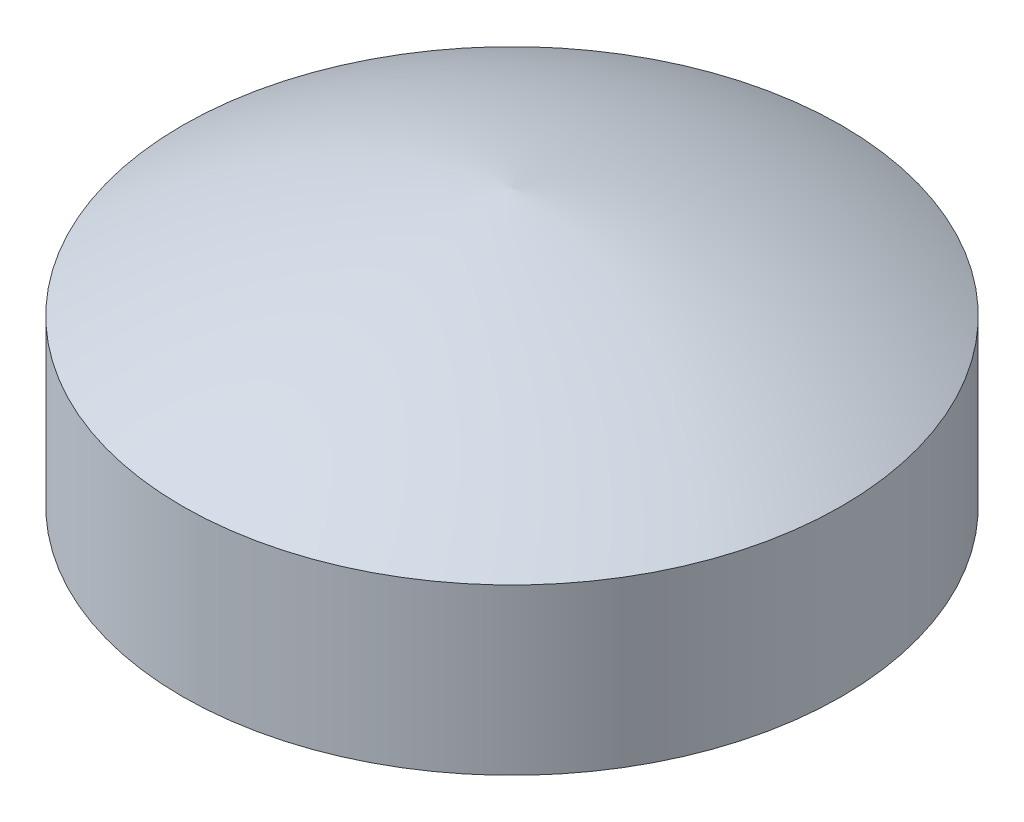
from build123d import *


with BuildPart() as part:
    # Sketch 1 → Revolve 1 (revolve)
    with BuildSketch(Plane.XY, mode=Mode.PRIVATE) as revolve_1_sk:
        with BuildLine():
            Line((0, 0), (3, 0))
            Line((3, 0), (3, 1.5))
            ThreePointArc((3, 1.5), (1.551682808, 2.155048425), (0, 2.5))
            Line((0, 2.5), (0, 0))
        make_face()
    revolve(revolve_1_sk.sketch.rotate(Axis((0, 0, 0), (0, 1, 0)), 90), axis=Axis((0, 0, 0), (0, 1, 0)))


solid = part.part
